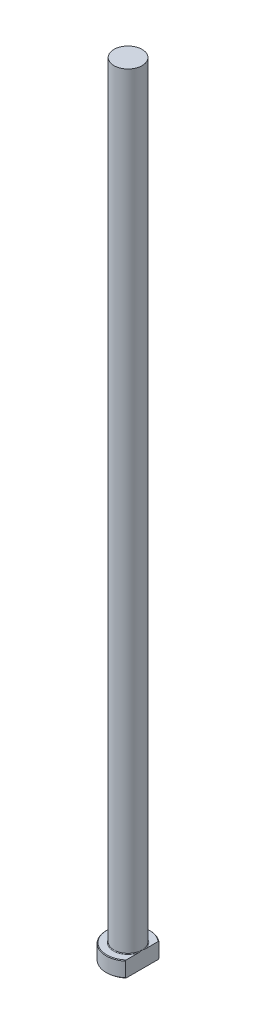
ISO-10303-21;
HEADER;
FILE_DESCRIPTION(('STEP AP214'),'2;1');
FILE_NAME('part.step','',(''),(''),'','','');
FILE_SCHEMA(('AUTOMOTIVE_DESIGN { 1 0 10303 214 1 1 1 1 }'));
ENDSEC;
DATA;
#1=APPLICATION_CONTEXT('core data for automotive mechanical design processes');
#2=APPLICATION_PROTOCOL_DEFINITION('international standard','automotive_design',2000,#1);
#3=PRODUCT_CONTEXT('',#1,'mechanical');
#4=PRODUCT('Part','Part','',(#3));
#5=PRODUCT_RELATED_PRODUCT_CATEGORY('part','',(#4));
#6=PRODUCT_DEFINITION_FORMATION('','',#4);
#7=PRODUCT_DEFINITION_CONTEXT('part definition',#1,'design');
#8=PRODUCT_DEFINITION('design','',#6,#7);
#9=PRODUCT_DEFINITION_SHAPE('','',#8);
#10=(LENGTH_UNIT() NAMED_UNIT(*) SI_UNIT(.MILLI.,.METRE.));
#11=(NAMED_UNIT(*) PLANE_ANGLE_UNIT() SI_UNIT($,.RADIAN.));
#12=(NAMED_UNIT(*) SI_UNIT($,.STERADIAN.) SOLID_ANGLE_UNIT());
#13=UNCERTAINTY_MEASURE_WITH_UNIT(LENGTH_MEASURE(1.E-05),#10,'distance_accuracy_value','');
#14=(GEOMETRIC_REPRESENTATION_CONTEXT(3) GLOBAL_UNCERTAINTY_ASSIGNED_CONTEXT((#13)) GLOBAL_UNIT_ASSIGNED_CONTEXT((#10,
#11,#12)) REPRESENTATION_CONTEXT('',''));
#15=CARTESIAN_POINT('',(0.,0.,0.));
#16=DIRECTION('',(0.,0.,1.));
#17=DIRECTION('',(1.,0.,0.));
#18=AXIS2_PLACEMENT_3D('',#15,#16,#17);
#19=CARTESIAN_POINT('',(0.,0.,0.));
#20=DIRECTION('',(0.,-1.,0.));
#21=DIRECTION('',(0.,0.,-1.));
#22=AXIS2_PLACEMENT_3D('',#19,#20,#21);
#23=PLANE('',#22);
#24=CARTESIAN_POINT('',(0.,0.,0.));
#25=DIRECTION('',(0.,-1.,0.));
#26=DIRECTION('',(0.,0.,-1.));
#27=AXIS2_PLACEMENT_3D('',#24,#25,#26);
#28=CIRCLE('',#27,6.79999999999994);
#29=CARTESIAN_POINT('',(4.49999999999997,0.,5.09803883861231));
#30=VERTEX_POINT('',#29);
#31=CARTESIAN_POINT('',(4.49999999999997,0.,-5.09803883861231));
#32=VERTEX_POINT('',#31);
#33=EDGE_CURVE('E98',#30,#32,#28,.T.);
#34=ORIENTED_EDGE('',*,*,#33,.T.);
#35=DIRECTION('',(0.,0.,1.));
#36=VECTOR('',#35,1.);
#37=CARTESIAN_POINT('',(4.49999999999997,0.,-5.36190264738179));
#38=LINE('',#37,#36);
#39=EDGE_CURVE('E83',#32,#30,#38,.T.);
#40=ORIENTED_EDGE('',*,*,#39,.T.);
#41=EDGE_LOOP('',(#34,#40));
#42=FACE_BOUND('',#41,.T.);
#43=ADVANCED_FACE('F32',(#42),#23,.T.);
#44=CARTESIAN_POINT('',(0.,259.958771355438,0.));
#45=DIRECTION('',(0.,1.,0.));
#46=DIRECTION('',(0.,0.,1.));
#47=AXIS2_PLACEMENT_3D('',#44,#45,#46);
#48=CYLINDRICAL_SURFACE('',#47,6.99999999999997);
#49=CARTESIAN_POINT('',(0.,4.80000000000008,0.));
#50=DIRECTION('',(0.,1.,0.));
#51=DIRECTION('',(0.,0.,1.));
#52=AXIS2_PLACEMENT_3D('',#49,#50,#51);
#53=CIRCLE('',#52,6.99999999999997);
#54=CARTESIAN_POINT('',(4.49999999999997,4.80000000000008,5.36190264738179));
#55=VERTEX_POINT('',#54);
#56=CARTESIAN_POINT('',(4.49999999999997,4.80000000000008,-5.36190264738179));
#57=VERTEX_POINT('',#56);
#58=EDGE_CURVE('E104',#55,#57,#53,.F.);
#59=ORIENTED_EDGE('',*,*,#58,.T.);
#60=DIRECTION('',(0.,-1.,0.));
#61=VECTOR('',#60,1.);
#62=CARTESIAN_POINT('',(4.49999999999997,250.,-5.36190264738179));
#63=LINE('',#62,#61);
#64=CARTESIAN_POINT('',(4.49999999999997,0.200000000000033,-5.36190264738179));
#65=VERTEX_POINT('',#64);
#66=EDGE_CURVE('E183',#57,#65,#63,.T.);
#67=ORIENTED_EDGE('',*,*,#66,.T.);
#68=CARTESIAN_POINT('',(0.,0.200000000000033,0.));
#69=DIRECTION('',(0.,-1.,0.));
#70=DIRECTION('',(0.,0.,-1.));
#71=AXIS2_PLACEMENT_3D('',#68,#69,#70);
#72=CIRCLE('',#71,6.99999999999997);
#73=CARTESIAN_POINT('',(4.49999999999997,0.200000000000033,5.36190264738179));
#74=VERTEX_POINT('',#73);
#75=EDGE_CURVE('E100',#65,#74,#72,.F.);
#76=ORIENTED_EDGE('',*,*,#75,.T.);
#77=DIRECTION('',(0.,-1.,0.));
#78=VECTOR('',#77,1.);
#79=CARTESIAN_POINT('',(4.49999999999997,250.,5.36190264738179));
#80=LINE('',#79,#78);
#81=EDGE_CURVE('E93',#55,#74,#80,.T.);
#82=ORIENTED_EDGE('',*,*,#81,.F.);
#83=EDGE_LOOP('',(#59,#67,#76,#82));
#84=FACE_BOUND('',#83,.T.);
#85=ADVANCED_FACE('F158',(#84),#48,.T.);
#86=CARTESIAN_POINT('',(-6.99999999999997,5.,0.));
#87=DIRECTION('',(0.,1.,0.));
#88=DIRECTION('',(0.,0.,1.));
#89=AXIS2_PLACEMENT_3D('',#86,#87,#88);
#90=PLANE('',#89);
#91=CARTESIAN_POINT('',(0.,5.,0.));
#92=DIRECTION('',(0.,1.,0.));
#93=DIRECTION('',(0.,0.,1.));
#94=AXIS2_PLACEMENT_3D('',#91,#92,#93);
#95=CIRCLE('',#94,6.80000000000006);
#96=CARTESIAN_POINT('',(4.49999999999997,5.,-5.09803883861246));
#97=VERTEX_POINT('',#96);
#98=CARTESIAN_POINT('',(4.49999999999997,5.,5.09803883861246));
#99=VERTEX_POINT('',#98);
#100=EDGE_CURVE('E178',#97,#99,#95,.T.);
#101=ORIENTED_EDGE('',*,*,#100,.T.);
#102=DIRECTION('',(0.,0.,-1.));
#103=VECTOR('',#102,1.);
#104=CARTESIAN_POINT('',(4.49999999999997,5.,0.));
#105=LINE('',#104,#103);
#106=CARTESIAN_POINT('',(4.49999999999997,4.99999999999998,1.35646599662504));
#107=VERTEX_POINT('',#106);
#108=EDGE_CURVE('E57',#99,#107,#105,.T.);
#109=ORIENTED_EDGE('',*,*,#108,.T.);
#110=CARTESIAN_POINT('',(0.,5.,0.));
#111=DIRECTION('',(0.,1.,0.));
#112=DIRECTION('',(0.,0.,1.));
#113=AXIS2_PLACEMENT_3D('',#110,#111,#112);
#114=CIRCLE('',#113,4.69999999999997);
#115=CARTESIAN_POINT('',(4.49999999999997,4.99999999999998,-1.35646599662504));
#116=VERTEX_POINT('',#115);
#117=EDGE_CURVE('E107',#107,#116,#114,.F.);
#118=ORIENTED_EDGE('',*,*,#117,.T.);
#119=EDGE_CURVE('E136',#116,#97,#105,.T.);
#120=ORIENTED_EDGE('',*,*,#119,.T.);
#121=EDGE_LOOP('',(#101,#109,#118,#120));
#122=FACE_BOUND('',#121,.T.);
#123=ADVANCED_FACE('F147',(#122),#90,.T.);
#124=CARTESIAN_POINT('',(0.,5.,0.));
#125=DIRECTION('',(0.,-1.,0.));
#126=DIRECTION('',(0.,0.,-1.));
#127=AXIS2_PLACEMENT_3D('',#124,#125,#126);
#128=CONICAL_SURFACE('',#127,6.80000000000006,0.785398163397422);
#129=ORIENTED_EDGE('',*,*,#58,.F.);
#130=CARTESIAN_POINT('',(4.49999999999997,-0.826603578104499,11.7975047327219));
#131=CARTESIAN_POINT('',(4.49999999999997,-0.656533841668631,11.6154797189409));
#132=CARTESIAN_POINT('',(4.49999999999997,-0.48672751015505,11.4332086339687));
#133=CARTESIAN_POINT('',(4.49999999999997,-0.147726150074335,11.0680967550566));
#134=CARTESIAN_POINT('',(4.49999999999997,0.0214688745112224,10.8852559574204));
#135=CARTESIAN_POINT('',(4.49999999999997,0.528086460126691,10.3356799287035));
#136=CARTESIAN_POINT('',(4.49999999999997,0.864461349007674,9.96797672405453));
#137=CARTESIAN_POINT('',(4.49999999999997,1.5359242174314,9.22638843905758));
#138=CARTESIAN_POINT('',(4.49999999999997,1.87098392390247,8.85247771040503));
#139=CARTESIAN_POINT('',(4.49999999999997,2.53567264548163,8.09993899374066));
#140=CARTESIAN_POINT('',(4.49999999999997,2.86530243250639,7.72131168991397));
#141=CARTESIAN_POINT('',(4.49999999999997,3.45461987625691,7.03004475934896));
#142=CARTESIAN_POINT('',(4.49999999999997,3.71567058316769,6.71857295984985));
#143=CARTESIAN_POINT('',(4.49999999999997,4.10171222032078,6.24673895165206));
#144=CARTESIAN_POINT('',(4.49999999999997,4.22949330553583,6.08866046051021));
#145=CARTESIAN_POINT('',(4.49999999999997,4.48278285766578,5.77069538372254));
#146=CARTESIAN_POINT('',(4.49999999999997,4.60829137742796,5.61080884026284));
#147=CARTESIAN_POINT('',(4.49999999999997,4.85630566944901,5.28917357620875));
#148=CARTESIAN_POINT('',(4.49999999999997,4.97881640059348,5.12742868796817));
#149=CARTESIAN_POINT('',(4.49999999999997,5.22038566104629,4.80138722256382));
#150=CARTESIAN_POINT('',(4.49999999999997,5.33944438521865,4.63709079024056));
#151=CARTESIAN_POINT('',(4.49999999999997,5.57315514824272,4.30551121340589));
#152=CARTESIAN_POINT('',(4.49999999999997,5.68780947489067,4.13822968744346));
#153=CARTESIAN_POINT('',(4.49999999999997,5.9115477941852,3.79999593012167));
#154=CARTESIAN_POINT('',(4.49999999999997,6.0206326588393,3.62904427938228));
#155=CARTESIAN_POINT('',(4.49999999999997,6.21658595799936,3.30732260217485));
#156=CARTESIAN_POINT('',(4.49999999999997,6.30440873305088,3.15713645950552));
#157=CARTESIAN_POINT('',(4.49999999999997,6.47332532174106,2.85297503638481));
#158=CARTESIAN_POINT('',(4.49999999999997,6.55441838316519,2.69899933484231));
#159=CARTESIAN_POINT('',(4.49999999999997,6.70797622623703,2.38687180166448));
#160=CARTESIAN_POINT('',(4.49999999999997,6.78044573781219,2.22872231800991));
#161=CARTESIAN_POINT('',(4.49999999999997,6.914451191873,1.90783021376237));
#162=CARTESIAN_POINT('',(4.49999999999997,6.97598991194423,1.74508877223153));
#163=CARTESIAN_POINT('',(4.49999999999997,7.07411688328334,1.44888794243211));
#164=CARTESIAN_POINT('',(4.49999999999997,7.11323376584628,1.31627139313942));
#165=CARTESIAN_POINT('',(4.49999999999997,7.18128524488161,1.04846462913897));
#166=CARTESIAN_POINT('',(4.49999999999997,7.21022354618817,0.913275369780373));
#167=CARTESIAN_POINT('',(4.49999999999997,7.25649613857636,0.641333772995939));
#168=CARTESIAN_POINT('',(4.49999999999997,7.27386660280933,0.504587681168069));
#169=CARTESIAN_POINT('',(4.49999999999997,7.29619809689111,0.230076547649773));
#170=CARTESIAN_POINT('',(4.49999999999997,7.30115982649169,0.0923115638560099));
#171=CARTESIAN_POINT('',(4.49999999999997,7.2983786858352,-0.18345502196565));
#172=CARTESIAN_POINT('',(4.49999999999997,7.29060196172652,-0.321456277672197));
#173=CARTESIAN_POINT('',(4.49999999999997,7.26273607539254,-0.596199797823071));
#174=CARTESIAN_POINT('',(4.49999999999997,7.24264594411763,-0.732941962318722));
#175=CARTESIAN_POINT('',(4.49999999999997,7.1911463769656,-1.00468961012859));
#176=CARTESIAN_POINT('',(4.49999999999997,7.15970172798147,-1.13968832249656));
#177=CARTESIAN_POINT('',(4.49999999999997,7.08693261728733,-1.40696616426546));
#178=CARTESIAN_POINT('',(4.49999999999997,7.04560769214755,-1.53924516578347));
#179=CARTESIAN_POINT('',(4.49999999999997,6.94926301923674,-1.81615594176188));
#180=CARTESIAN_POINT('',(4.49999999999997,6.89320710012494,-1.96042418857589));
#181=CARTESIAN_POINT('',(4.49999999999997,6.77257673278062,-2.24536359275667));
#182=CARTESIAN_POINT('',(4.49999999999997,6.70799968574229,-2.38603363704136));
#183=CARTESIAN_POINT('',(4.49999999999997,6.57186656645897,-2.66422978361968));
#184=CARTESIAN_POINT('',(4.49999999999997,6.50029866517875,-2.80175005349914));
#185=CARTESIAN_POINT('',(4.49999999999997,6.35162424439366,-3.07372108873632));
#186=CARTESIAN_POINT('',(4.49999999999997,6.27451843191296,-3.20817224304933));
#187=CARTESIAN_POINT('',(4.49999999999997,6.11478562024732,-3.47611571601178));
#188=CARTESIAN_POINT('',(4.49999999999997,6.03209988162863,-3.6095728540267));
#189=CARTESIAN_POINT('',(4.49999999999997,5.8629804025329,-3.87408571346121));
#190=CARTESIAN_POINT('',(4.49999999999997,5.77654657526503,-4.00514137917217));
#191=CARTESIAN_POINT('',(4.49999999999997,5.6006924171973,-4.26503919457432));
#192=CARTESIAN_POINT('',(4.49999999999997,5.51127511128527,-4.39388339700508));
#193=CARTESIAN_POINT('',(4.49999999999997,5.32990145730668,-4.64976494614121));
#194=CARTESIAN_POINT('',(4.49999999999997,5.2379451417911,-4.77680231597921));
#195=CARTESIAN_POINT('',(4.49999999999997,5.02845923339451,-5.06114674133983));
#196=CARTESIAN_POINT('',(4.49999999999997,4.91032759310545,-5.21800978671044));
#197=CARTESIAN_POINT('',(4.49999999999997,4.67137262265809,-5.52967502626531));
#198=CARTESIAN_POINT('',(4.49999999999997,4.55054918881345,-5.6844771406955));
#199=CARTESIAN_POINT('',(4.49999999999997,4.18476750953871,-6.14632269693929));
#200=CARTESIAN_POINT('',(4.49999999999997,3.93652718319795,-6.45076612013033));
#201=CARTESIAN_POINT('',(4.49999999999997,3.433758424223,-7.05492264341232));
#202=CARTESIAN_POINT('',(4.49999999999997,3.17922364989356,-7.35463042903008));
#203=CARTESIAN_POINT('',(4.49999999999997,2.66577175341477,-7.95027689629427));
#204=CARTESIAN_POINT('',(4.49999999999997,2.40685449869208,-8.24621546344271));
#205=CARTESIAN_POINT('',(4.49999999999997,1.90253774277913,-8.81624717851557));
#206=CARTESIAN_POINT('',(4.49999999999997,1.6573410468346,-9.0905201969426));
#207=CARTESIAN_POINT('',(4.49999999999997,1.16472214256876,-9.63707062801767));
#208=CARTESIAN_POINT('',(4.49999999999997,0.91729987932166,-9.90934799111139));
#209=CARTESIAN_POINT('',(4.49999999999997,0.421259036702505,-10.4516873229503));
#210=CARTESIAN_POINT('',(4.49999999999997,0.172644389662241,-10.7217528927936));
#211=CARTESIAN_POINT('',(4.49999999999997,-0.325997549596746,-11.2605533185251));
#212=CARTESIAN_POINT('',(4.49999999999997,-0.576024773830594,-11.5292882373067));
#213=CARTESIAN_POINT('',(4.49999999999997,-0.826603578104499,-11.7975047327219));
#214=B_SPLINE_CURVE_WITH_KNOTS('',3,(#130,#131,#132,#133,#134,#135,#136,#137,#138,#139,#140,
#141,#142,#143,#144,#145,#146,#147,#148,#149,#150,#151,#152,#153,#154,#155,#156,#157,#158,#159,
#160,#161,#162,#163,#164,#165,#166,#167,#168,#169,#170,#171,#172,#173,#174,#175,#176,#177,#178,
#179,#180,#181,#182,#183,#184,#185,#186,#187,#188,#189,#190,#191,#192,#193,#194,#195,#196,#197,
#198,#199,#200,#201,#202,#203,#204,#205,#206,#207,#208,#209,#210,#211,#212,#213),.UNSPECIFIED.,
.F.,.F.,(4,2,2,2,2,2,2,2,2,2,2,2,2,2,2,2,2,2,2,2,2,2,2,2,2,2,2,2,2,2,2,2,2,2,2,2,2,2,2,2,2,4),
(0.,0.747335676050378,1.49467621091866,2.98970927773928,4.49588412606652,6.00184297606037,
7.22095514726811,7.83073509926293,8.44050085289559,9.04917844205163,9.65782160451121,
10.2661442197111,10.8743712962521,11.396174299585,11.9180355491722,12.4396092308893,
12.9610501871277,13.3755059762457,13.789810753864,14.2028138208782,14.6157935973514,
15.0298726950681,15.4439843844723,15.8593915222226,16.2748181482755,16.7388057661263,
17.2029352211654,17.6678640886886,18.1327337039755,18.6036459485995,19.0745691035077,
19.5450285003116,20.0154818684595,20.6045534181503,21.1936476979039,22.3719830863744,
23.5515583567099,24.7311693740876,25.8348416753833,26.9385412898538,28.0397632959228,
29.1409327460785),.UNSPECIFIED.);
#215=EDGE_CURVE('E135',#55,#99,#214,.T.);
#216=ORIENTED_EDGE('',*,*,#215,.T.);
#217=ORIENTED_EDGE('',*,*,#100,.F.);
#218=EDGE_CURVE('E127',#97,#57,#214,.T.);
#219=ORIENTED_EDGE('',*,*,#218,.T.);
#220=EDGE_LOOP('',(#129,#216,#217,#219));
#221=FACE_BOUND('',#220,.T.);
#222=ADVANCED_FACE('F143',(#221),#128,.T.);
#223=CARTESIAN_POINT('',(0.,0.200000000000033,0.));
#224=DIRECTION('',(0.,1.,0.));
#225=DIRECTION('',(0.,0.,1.));
#226=AXIS2_PLACEMENT_3D('',#223,#224,#225);
#227=CONICAL_SURFACE('',#226,6.99999999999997,0.785398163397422);
#228=ORIENTED_EDGE('',*,*,#75,.F.);
#229=CARTESIAN_POINT('',(4.49999999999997,5.82660357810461,-11.7975047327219));
#230=CARTESIAN_POINT('',(4.49999999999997,5.65653384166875,-11.6154797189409));
#231=CARTESIAN_POINT('',(4.49999999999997,5.48672751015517,-11.4332086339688));
#232=CARTESIAN_POINT('',(4.49999999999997,5.14772615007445,-11.0680967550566));
#233=CARTESIAN_POINT('',(4.49999999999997,4.97853112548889,-10.8852559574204));
#234=CARTESIAN_POINT('',(4.49999999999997,4.47191353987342,-10.3356799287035));
#235=CARTESIAN_POINT('',(4.49999999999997,4.13553865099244,-9.96797672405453));
#236=CARTESIAN_POINT('',(4.49999999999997,3.46407578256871,-9.22638843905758));
#237=CARTESIAN_POINT('',(4.49999999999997,3.12901607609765,-8.85247771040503));
#238=CARTESIAN_POINT('',(4.49999999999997,2.46432735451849,-8.09993899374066));
#239=CARTESIAN_POINT('',(4.49999999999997,2.13469756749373,-7.72131168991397));
#240=CARTESIAN_POINT('',(4.49999999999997,1.54538012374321,-7.03004475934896));
#241=CARTESIAN_POINT('',(4.49999999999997,1.28432941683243,-6.71857295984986));
#242=CARTESIAN_POINT('',(4.49999999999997,0.898287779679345,-6.24673895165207));
#243=CARTESIAN_POINT('',(4.49999999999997,0.770506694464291,-6.08866046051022));
#244=CARTESIAN_POINT('',(4.49999999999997,0.517217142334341,-5.77069538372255));
#245=CARTESIAN_POINT('',(4.49999999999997,0.391708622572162,-5.61080884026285));
#246=CARTESIAN_POINT('',(4.49999999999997,0.14369433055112,-5.28917357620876));
#247=CARTESIAN_POINT('',(4.49999999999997,0.021183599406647,-5.12742868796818));
#248=CARTESIAN_POINT('',(4.49999999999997,-0.220385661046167,-4.80138722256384));
#249=CARTESIAN_POINT('',(4.49999999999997,-0.339444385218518,-4.63709079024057));
#250=CARTESIAN_POINT('',(4.49999999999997,-0.573155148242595,-4.3055112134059));
#251=CARTESIAN_POINT('',(4.49999999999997,-0.68780947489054,-4.13822968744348));
#252=CARTESIAN_POINT('',(4.49999999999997,-0.911547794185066,-3.79999593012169));
#253=CARTESIAN_POINT('',(4.49999999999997,-1.02063265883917,-3.62904427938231));
#254=CARTESIAN_POINT('',(4.49999999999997,-1.21658595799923,-3.30732260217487));
#255=CARTESIAN_POINT('',(4.49999999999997,-1.30440873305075,-3.15713645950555));
#256=CARTESIAN_POINT('',(4.49999999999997,-1.47332532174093,-2.85297503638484));
#257=CARTESIAN_POINT('',(4.49999999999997,-1.55441838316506,-2.69899933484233));
#258=CARTESIAN_POINT('',(4.49999999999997,-1.7079762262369,-2.38687180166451));
#259=CARTESIAN_POINT('',(4.49999999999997,-1.78044573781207,-2.22872231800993));
#260=CARTESIAN_POINT('',(4.49999999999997,-1.91445119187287,-1.9078302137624));
#261=CARTESIAN_POINT('',(4.49999999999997,-1.97598991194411,-1.74508877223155));
#262=CARTESIAN_POINT('',(4.49999999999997,-2.07411688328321,-1.44888794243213));
#263=CARTESIAN_POINT('',(4.49999999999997,-2.11323376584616,-1.31627139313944));
#264=CARTESIAN_POINT('',(4.49999999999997,-2.18128524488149,-1.04846462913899));
#265=CARTESIAN_POINT('',(4.49999999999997,-2.21022354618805,-0.913275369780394));
#266=CARTESIAN_POINT('',(4.49999999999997,-2.25649613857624,-0.641333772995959));
#267=CARTESIAN_POINT('',(4.49999999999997,-2.27386660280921,-0.504587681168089));
#268=CARTESIAN_POINT('',(4.49999999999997,-2.29619809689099,-0.230076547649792));
#269=CARTESIAN_POINT('',(4.49999999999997,-2.30115982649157,-0.0923115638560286));
#270=CARTESIAN_POINT('',(4.49999999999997,-2.29837868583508,0.183455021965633));
#271=CARTESIAN_POINT('',(4.49999999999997,-2.2906019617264,0.32145627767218));
#272=CARTESIAN_POINT('',(4.49999999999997,-2.26273607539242,0.596199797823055));
#273=CARTESIAN_POINT('',(4.49999999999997,-2.24264594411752,0.732941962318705));
#274=CARTESIAN_POINT('',(4.49999999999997,-2.19114637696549,1.00468961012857));
#275=CARTESIAN_POINT('',(4.49999999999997,-2.15970172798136,1.13968832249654));
#276=CARTESIAN_POINT('',(4.49999999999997,-2.08693261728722,1.40696616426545));
#277=CARTESIAN_POINT('',(4.49999999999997,-2.04560769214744,1.53924516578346));
#278=CARTESIAN_POINT('',(4.49999999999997,-1.94926301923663,1.81615594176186));
#279=CARTESIAN_POINT('',(4.49999999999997,-1.89320710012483,1.96042418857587));
#280=CARTESIAN_POINT('',(4.49999999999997,-1.77257673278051,2.24536359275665));
#281=CARTESIAN_POINT('',(4.49999999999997,-1.70799968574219,2.38603363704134));
#282=CARTESIAN_POINT('',(4.49999999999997,-1.57186656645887,2.66422978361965));
#283=CARTESIAN_POINT('',(4.49999999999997,-1.50029866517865,2.80175005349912));
#284=CARTESIAN_POINT('',(4.49999999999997,-1.35162424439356,3.07372108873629));
#285=CARTESIAN_POINT('',(4.49999999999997,-1.27451843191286,3.2081722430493));
#286=CARTESIAN_POINT('',(4.49999999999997,-1.11478562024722,3.47611571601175));
#287=CARTESIAN_POINT('',(4.49999999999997,-1.03209988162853,3.60957285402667));
#288=CARTESIAN_POINT('',(4.49999999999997,-0.862980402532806,3.87408571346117));
#289=CARTESIAN_POINT('',(4.49999999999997,-0.776546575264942,4.00514137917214));
#290=CARTESIAN_POINT('',(4.49999999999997,-0.600692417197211,4.26503919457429));
#291=CARTESIAN_POINT('',(4.49999999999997,-0.511275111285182,4.39388339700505));
#292=CARTESIAN_POINT('',(4.49999999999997,-0.329901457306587,4.64976494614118));
#293=CARTESIAN_POINT('',(4.49999999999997,-0.237945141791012,4.77680231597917));
#294=CARTESIAN_POINT('',(4.49999999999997,-0.0284592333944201,5.06114674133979));
#295=CARTESIAN_POINT('',(4.49999999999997,0.0896724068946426,5.21800978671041));
#296=CARTESIAN_POINT('',(4.49999999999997,0.328627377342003,5.52967502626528));
#297=CARTESIAN_POINT('',(4.49999999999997,0.449450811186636,5.68447714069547));
#298=CARTESIAN_POINT('',(4.49999999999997,0.81523249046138,6.14632269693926));
#299=CARTESIAN_POINT('',(4.49999999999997,1.06347281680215,6.45076612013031));
#300=CARTESIAN_POINT('',(4.49999999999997,1.5662415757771,7.05492264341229));
#301=CARTESIAN_POINT('',(4.49999999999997,1.82077635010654,7.35463042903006));
#302=CARTESIAN_POINT('',(4.49999999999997,2.33422824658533,7.95027689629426));
#303=CARTESIAN_POINT('',(4.49999999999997,2.59314550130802,8.24621546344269));
#304=CARTESIAN_POINT('',(4.49999999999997,3.09746225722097,8.81624717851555));
#305=CARTESIAN_POINT('',(4.49999999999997,3.3426589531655,9.09052019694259));
#306=CARTESIAN_POINT('',(4.49999999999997,3.83527785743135,9.63707062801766));
#307=CARTESIAN_POINT('',(4.49999999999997,4.08270012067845,9.90934799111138));
#308=CARTESIAN_POINT('',(4.49999999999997,4.5787409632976,10.4516873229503));
#309=CARTESIAN_POINT('',(4.49999999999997,4.82735561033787,10.7217528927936));
#310=CARTESIAN_POINT('',(4.49999999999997,5.32599754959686,11.2605533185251));
#311=CARTESIAN_POINT('',(4.49999999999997,5.57602477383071,11.5292882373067));
#312=CARTESIAN_POINT('',(4.49999999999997,5.82660357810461,11.7975047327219));
#313=B_SPLINE_CURVE_WITH_KNOTS('',3,(#229,#230,#231,#232,#233,#234,#235,#236,#237,#238,#239,
#240,#241,#242,#243,#244,#245,#246,#247,#248,#249,#250,#251,#252,#253,#254,#255,#256,#257,#258,
#259,#260,#261,#262,#263,#264,#265,#266,#267,#268,#269,#270,#271,#272,#273,#274,#275,#276,#277,
#278,#279,#280,#281,#282,#283,#284,#285,#286,#287,#288,#289,#290,#291,#292,#293,#294,#295,#296,
#297,#298,#299,#300,#301,#302,#303,#304,#305,#306,#307,#308,#309,#310,#311,#312),.UNSPECIFIED.,
.F.,.F.,(4,2,2,2,2,2,2,2,2,2,2,2,2,2,2,2,2,2,2,2,2,2,2,2,2,2,2,2,2,2,2,2,2,2,2,2,2,2,2,2,2,4),
(0.,0.747335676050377,1.49467621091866,2.98970927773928,4.49588412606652,6.00184297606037,
7.2209551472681,7.83073509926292,8.44050085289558,9.04917844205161,9.65782160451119,
10.266144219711,10.874371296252,11.3961742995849,11.9180355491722,12.4396092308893,
12.9610501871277,13.3755059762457,13.789810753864,14.2028138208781,14.6157935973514,
15.029872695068,15.4439843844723,15.8593915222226,16.2748181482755,16.7388057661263,
17.2029352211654,17.6678640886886,18.1327337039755,18.6036459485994,19.0745691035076,
19.5450285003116,20.0154818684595,20.6045534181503,21.1936476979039,22.3719830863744,
23.5515583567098,24.7311693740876,25.8348416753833,26.9385412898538,28.0397632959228,
29.1409327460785),.UNSPECIFIED.);
#314=EDGE_CURVE('E86',#65,#32,#313,.T.);
#315=ORIENTED_EDGE('',*,*,#314,.T.);
#316=ORIENTED_EDGE('',*,*,#33,.F.);
#317=EDGE_CURVE('E89',#30,#74,#313,.T.);
#318=ORIENTED_EDGE('',*,*,#317,.T.);
#319=EDGE_LOOP('',(#228,#315,#316,#318));
#320=FACE_BOUND('',#319,.T.);
#321=ADVANCED_FACE('F97',(#320),#227,.T.);
#322=CARTESIAN_POINT('',(0.,5.19999999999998,0.));
#323=DIRECTION('',(0.,1.,0.));
#324=DIRECTION('',(0.,0.,1.));
#325=AXIS2_PLACEMENT_3D('',#322,#323,#324);
#326=TOROIDAL_SURFACE('',#325,4.69999999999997,0.2);
#327=CARTESIAN_POINT('',(4.49999999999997,5.19999999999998,0.));
#328=CARTESIAN_POINT('',(4.49999999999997,5.20000055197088,-6.82190207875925E-09));
#329=CARTESIAN_POINT('',(4.49999999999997,5.20000110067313,-2.8507749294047E-07));
#330=CARTESIAN_POINT('',(4.49999999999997,5.20000211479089,-1.011869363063E-06));
#331=CARTESIAN_POINT('',(4.49999999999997,5.20000255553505,-1.47962814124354E-06));
#332=CARTESIAN_POINT('',(4.49999999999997,5.20000349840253,-2.60944744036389E-06));
#333=CARTESIAN_POINT('',(4.49999999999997,5.2000039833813,-3.28932128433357E-06));
#334=CARTESIAN_POINT('',(4.49999999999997,5.20000482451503,-4.67191774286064E-06));
#335=CARTESIAN_POINT('',(4.49999999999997,5.20000518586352,-5.37183781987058E-06));
#336=CARTESIAN_POINT('',(4.49999999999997,5.2000065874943,-8.170073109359E-06));
#337=CARTESIAN_POINT('',(4.49999999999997,5.2000075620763,-1.03053692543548E-05));
#338=CARTESIAN_POINT('',(4.49999999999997,5.20000909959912,-1.44577153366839E-05));
#339=CARTESIAN_POINT('',(4.49999999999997,5.20000969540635,-1.64630059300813E-05));
#340=CARTESIAN_POINT('',(4.49999999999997,5.20001228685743,-2.51554967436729E-05));
#341=CARTESIAN_POINT('',(4.49999999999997,5.20001430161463,-3.18381715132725E-05));
#342=CARTESIAN_POINT('',(4.49999999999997,5.20001716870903,-4.42838289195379E-05));
#343=CARTESIAN_POINT('',(4.49999999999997,5.20001815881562,-5.00144685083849E-05));
#344=CARTESIAN_POINT('',(4.49999999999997,5.20002543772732,-9.26835273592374E-05));
#345=CARTESIAN_POINT('',(4.49999999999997,5.20003122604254,-0.000129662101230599));
#346=CARTESIAN_POINT('',(4.49999999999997,5.20005596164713,-0.000272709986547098));
#347=CARTESIAN_POINT('',(4.49999999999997,5.20007919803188,-0.00037804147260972));
#348=CARTESIAN_POINT('',(4.49999999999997,5.20016600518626,-0.000777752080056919));
#349=CARTESIAN_POINT('',(4.49999999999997,5.2002271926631,-0.00107246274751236));
#350=CARTESIAN_POINT('',(4.49999999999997,5.20046266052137,-0.00220073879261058));
#351=CARTESIAN_POINT('',(4.49999999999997,5.20063910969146,-0.00303403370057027));
#352=CARTESIAN_POINT('',(4.49999999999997,5.20146807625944,-0.00695397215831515));
#353=CARTESIAN_POINT('',(4.49999999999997,5.20211775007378,-0.0100409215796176));
#354=CARTESIAN_POINT('',(4.49999999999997,5.2104625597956,-0.0496851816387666));
#355=CARTESIAN_POINT('',(4.49999999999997,5.2181721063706,-0.0862414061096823));
#356=CARTESIAN_POINT('',(4.49999999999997,5.23425793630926,-0.163016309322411));
#357=CARTESIAN_POINT('',(4.49999999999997,5.24262411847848,-0.203237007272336));
#358=CARTESIAN_POINT('',(4.49999999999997,5.25647489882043,-0.270691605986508));
#359=CARTESIAN_POINT('',(4.49999999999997,5.26201543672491,-0.297913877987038));
#360=CARTESIAN_POINT('',(4.49999999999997,5.27283497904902,-0.351731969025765));
#361=CARTESIAN_POINT('',(4.49999999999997,5.27811706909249,-0.378327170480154));
#362=CARTESIAN_POINT('',(4.49999999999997,5.29540054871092,-0.466700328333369));
#363=CARTESIAN_POINT('',(4.49999999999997,5.30706090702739,-0.528546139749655));
#364=CARTESIAN_POINT('',(4.49999999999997,5.32919553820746,-0.652993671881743));
#365=CARTESIAN_POINT('',(4.49999999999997,5.33965890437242,-0.715597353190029));
#366=CARTESIAN_POINT('',(4.49999999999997,5.35981150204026,-0.848050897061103));
#367=CARTESIAN_POINT('',(4.49999999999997,5.36928619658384,-0.917934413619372));
#368=CARTESIAN_POINT('',(4.49999999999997,5.38501179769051,-1.05789403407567));
#369=CARTESIAN_POINT('',(4.49999999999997,5.39127087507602,-1.12796919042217));
#370=CARTESIAN_POINT('',(4.49999999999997,5.39912931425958,-1.26576099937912));
#371=CARTESIAN_POINT('',(4.49999999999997,5.40089657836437,-1.33346617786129));
#372=CARTESIAN_POINT('',(4.49999999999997,5.39892238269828,-1.43427893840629));
#373=CARTESIAN_POINT('',(4.49999999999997,5.39752994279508,-1.46742827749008));
#374=CARTESIAN_POINT('',(4.49999999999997,5.39286046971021,-1.53357775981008));
#375=CARTESIAN_POINT('',(4.49999999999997,5.38958468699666,-1.56657798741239));
#376=CARTESIAN_POINT('',(4.49999999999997,5.38053340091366,-1.63263406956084));
#377=CARTESIAN_POINT('',(4.49999999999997,5.37473096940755,-1.66568659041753));
#378=CARTESIAN_POINT('',(4.49999999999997,5.363351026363,-1.71471614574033));
#379=CARTESIAN_POINT('',(4.49999999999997,5.35910046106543,-1.73099981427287));
#380=CARTESIAN_POINT('',(4.49999999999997,5.34948134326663,-1.76322922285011));
#381=CARTESIAN_POINT('',(4.49999999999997,5.34411369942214,-1.77917522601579));
#382=CARTESIAN_POINT('',(4.49999999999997,5.33191498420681,-1.81057972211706));
#383=CARTESIAN_POINT('',(4.49999999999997,5.32507796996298,-1.82603593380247));
#384=CARTESIAN_POINT('',(4.49999999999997,5.30945990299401,-1.85590044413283));
#385=CARTESIAN_POINT('',(4.49999999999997,5.3006900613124,-1.87031417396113));
#386=CARTESIAN_POINT('',(4.49999999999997,5.28636937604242,-1.88912645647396));
#387=CARTESIAN_POINT('',(4.49999999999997,5.28198345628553,-1.89440539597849));
#388=CARTESIAN_POINT('',(4.49999999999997,5.27265048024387,-1.90446776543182));
#389=CARTESIAN_POINT('',(4.49999999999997,5.26770253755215,-1.90925038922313));
#390=CARTESIAN_POINT('',(4.49999999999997,5.25711045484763,-1.91814546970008));
#391=CARTESIAN_POINT('',(4.49999999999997,5.25145790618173,-1.92224813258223));
#392=CARTESIAN_POINT('',(4.49999999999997,5.23949451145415,-1.92934216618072));
#393=CARTESIAN_POINT('',(4.49999999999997,5.23318629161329,-1.93233776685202));
#394=CARTESIAN_POINT('',(4.49999999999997,5.22225980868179,-1.93605363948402));
#395=CARTESIAN_POINT('',(4.49999999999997,5.21778688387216,-1.93720033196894));
#396=CARTESIAN_POINT('',(4.49999999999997,5.20871133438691,-1.93872266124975));
#397=CARTESIAN_POINT('',(4.49999999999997,5.20410881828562,-1.9390989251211));
#398=CARTESIAN_POINT('',(4.49999999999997,5.19490368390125,-1.939041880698));
#399=CARTESIAN_POINT('',(4.49999999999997,5.19030107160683,-1.93860763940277));
#400=CARTESIAN_POINT('',(4.49999999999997,5.18123418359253,-1.93697295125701));
#401=CARTESIAN_POINT('',(4.49999999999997,5.17677002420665,-1.93577187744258));
#402=CARTESIAN_POINT('',(4.49999999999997,5.1668471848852,-1.93227382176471));
#403=CARTESIAN_POINT('',(4.49999999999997,5.16146458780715,-1.92976289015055));
#404=CARTESIAN_POINT('',(4.49999999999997,5.15117210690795,-1.92391275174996));
#405=CARTESIAN_POINT('',(4.49999999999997,5.1462632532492,-1.92057179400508));
#406=CARTESIAN_POINT('',(4.49999999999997,5.13406500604,-1.91106955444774));
#407=CARTESIAN_POINT('',(4.49999999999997,5.1271509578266,-1.90443135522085));
#408=CARTESIAN_POINT('',(4.49999999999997,5.1143641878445,-1.89022781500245));
#409=CARTESIAN_POINT('',(4.49999999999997,5.10849431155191,-1.88266003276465));
#410=CARTESIAN_POINT('',(4.49999999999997,5.09196345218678,-1.85885313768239));
#411=CARTESIAN_POINT('',(4.49999999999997,5.08260528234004,-1.84172098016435));
#412=CARTESIAN_POINT('',(4.49999999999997,5.0661847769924,-1.80641645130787));
#413=CARTESIAN_POINT('',(4.49999999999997,5.05912924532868,-1.78824118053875));
#414=CARTESIAN_POINT('',(4.49999999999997,5.04323663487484,-1.74113187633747));
#415=CARTESIAN_POINT('',(4.49999999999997,5.03557186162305,-1.7118061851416));
#416=CARTESIAN_POINT('',(4.49999999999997,5.02293045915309,-1.6525641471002));
#417=CARTESIAN_POINT('',(4.49999999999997,5.01795986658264,-1.62264662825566));
#418=CARTESIAN_POINT('',(4.49999999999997,5.01001791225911,-1.56241066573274));
#419=CARTESIAN_POINT('',(4.49999999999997,5.00705603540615,-1.53209099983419));
#420=CARTESIAN_POINT('',(4.49999999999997,5.00272853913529,-1.4713805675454));
#421=CARTESIAN_POINT('',(4.49999999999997,5.00136115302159,-1.44098991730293));
#422=CARTESIAN_POINT('',(4.49999999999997,4.99922532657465,-1.3517640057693));
#423=CARTESIAN_POINT('',(4.49999999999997,5.00021079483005,-1.29288773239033));
#424=CARTESIAN_POINT('',(4.49999999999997,5.00555979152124,-1.17527759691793));
#425=CARTESIAN_POINT('',(4.49999999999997,5.0099258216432,-1.11654387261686));
#426=CARTESIAN_POINT('',(4.49999999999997,5.02118223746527,-0.999199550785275));
#427=CARTESIAN_POINT('',(4.49999999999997,5.02807797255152,-0.940589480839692));
#428=CARTESIAN_POINT('',(4.49999999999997,5.04376271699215,-0.823619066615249));
#429=CARTESIAN_POINT('',(4.49999999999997,5.05255207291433,-0.765258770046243));
#430=CARTESIAN_POINT('',(4.49999999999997,5.08097305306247,-0.59074120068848));
#431=CARTESIAN_POINT('',(4.49999999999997,5.10268261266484,-0.474928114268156));
#432=CARTESIAN_POINT('',(4.49999999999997,5.14864719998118,-0.243827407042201));
#433=CARTESIAN_POINT('',(4.49999999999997,5.1729024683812,-0.128539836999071));
#434=CARTESIAN_POINT('',(4.49999999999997,5.19721381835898,-0.013216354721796));
#435=CARTESIAN_POINT('',(4.49999999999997,5.19722314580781,-0.0131721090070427));
#436=CARTESIAN_POINT('',(4.49999999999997,5.19779043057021,-0.0104809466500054));
#437=CARTESIAN_POINT('',(4.49999999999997,5.19834611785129,-0.00783370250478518));
#438=CARTESIAN_POINT('',(4.49999999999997,5.19915446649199,-0.00401576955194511));
#439=CARTESIAN_POINT('',(4.49999999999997,5.19940338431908,-0.00284453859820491));
#440=CARTESIAN_POINT('',(4.49999999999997,5.19972657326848,-0.00129224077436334));
#441=CARTESIAN_POINT('',(4.49999999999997,5.19980524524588,-0.000911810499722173));
#442=CARTESIAN_POINT('',(4.49999999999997,5.19991316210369,-0.000412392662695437));
#443=CARTESIAN_POINT('',(4.49999999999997,5.199939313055,-0.000292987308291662));
#444=CARTESIAN_POINT('',(4.49999999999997,5.19996676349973,-0.000133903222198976));
#445=CARTESIAN_POINT('',(4.49999999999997,5.19997289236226,-9.50488513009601E-05));
#446=CARTESIAN_POINT('',(4.49999999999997,5.19998085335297,-5.04499399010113E-05));
#447=CARTESIAN_POINT('',(4.49999999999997,5.19998191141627,-4.46245658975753E-05));
#448=CARTESIAN_POINT('',(4.49999999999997,5.19998498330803,-3.19756841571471E-05));
#449=CARTESIAN_POINT('',(4.49999999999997,5.19998714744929,-2.518933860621E-05));
#450=CARTESIAN_POINT('',(4.49999999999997,5.19998992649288,-1.63868871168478E-05));
#451=CARTESIAN_POINT('',(4.49999999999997,5.19999055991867,-1.43745410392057E-05));
#452=CARTESIAN_POINT('',(4.49999999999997,5.19999218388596,-1.02133648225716E-05));
#453=CARTESIAN_POINT('',(4.49999999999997,5.19999320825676,-8.07729849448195E-06));
#454=CARTESIAN_POINT('',(4.49999999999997,5.19999467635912,-5.28414581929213E-06));
#455=CARTESIAN_POINT('',(4.49999999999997,5.19999505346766,-4.58771677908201E-06));
#456=CARTESIAN_POINT('',(4.49999999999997,5.19999592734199,-3.21494462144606E-06));
#457=CARTESIAN_POINT('',(4.49999999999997,5.19999642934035,-2.5415638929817E-06));
#458=CARTESIAN_POINT('',(4.49999999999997,5.19999740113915,-1.42657027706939E-06));
#459=CARTESIAN_POINT('',(4.49999999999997,5.19999785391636,-9.66495650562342E-07));
#460=CARTESIAN_POINT('',(4.49999999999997,5.19999888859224,-2.59794050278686E-07));
#461=CARTESIAN_POINT('',(4.49999999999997,5.19999944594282,6.84768658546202E-09));
#462=CARTESIAN_POINT('',(4.49999999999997,5.19999999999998,0.));
#463=B_SPLINE_CURVE_WITH_KNOTS('',3,(#327,#328,#329,#330,#331,#332,#333,#334,#335,#336,#337,
#338,#339,#340,#341,#342,#343,#344,#345,#346,#347,#348,#349,#350,#351,#352,#353,#354,#355,#356,
#357,#358,#359,#360,#361,#362,#363,#364,#365,#366,#367,#368,#369,#370,#371,#372,#373,#374,#375,
#376,#377,#378,#379,#380,#381,#382,#383,#384,#385,#386,#387,#388,#389,#390,#391,#392,#393,#394,
#395,#396,#397,#398,#399,#400,#401,#402,#403,#404,#405,#406,#407,#408,#409,#410,#411,#412,#413,
#414,#415,#416,#417,#418,#419,#420,#421,#422,#423,#424,#425,#426,#427,#428,#429,#430,#431,#432,
#433,#434,#435,#436,#437,#438,#439,#440,#441,#442,#443,#444,#445,#446,#447,#448,#449,#450,#451,
#452,#453,#454,#455,#456,#457,#458,#459,#460,#461,#462),.UNSPECIFIED.,.T.,.F.,(4,2,2,2,2,2,2,2,
2,2,2,2,2,2,2,2,2,2,2,2,2,2,2,2,2,2,2,2,2,2,2,2,2,2,2,2,2,2,2,2,2,2,2,2,2,2,2,2,2,2,2,2,2,2,2,2,
2,2,2,2,2,2,2,2,2,2,2,4),(0.,1.69150264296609E-06,3.63558631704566E-06,6.12166225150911E-06,
8.48452135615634E-06,1.55048842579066E-05,2.17748008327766E-05,4.26896425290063E-05,
6.01187537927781E-05,0.000172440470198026,0.000495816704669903,0.00139901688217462,
0.00395409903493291,0.0134181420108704,0.125496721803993,0.248741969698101,0.332082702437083,
0.413426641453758,0.602223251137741,0.792622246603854,1.00413639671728,1.21511040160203,
1.4180738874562,1.51756782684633,1.61699578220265,1.71751038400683,1.76796997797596,
1.81838868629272,1.86901528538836,1.9193556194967,1.9399151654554,1.96050759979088,
1.98137480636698,2.0021614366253,2.01595568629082,2.0297387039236,2.04353759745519,
2.05734778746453,2.0750662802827,2.0928224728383,2.12141432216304,2.1500829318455,
2.20832061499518,2.26672885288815,2.35743544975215,2.44834445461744,2.53967978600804,
2.63091382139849,2.80740805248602,2.98403301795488,3.1610336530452,3.33806671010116,
3.69147200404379,4.04491074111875,4.04504639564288,4.0531616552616,4.0567534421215,
4.05791916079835,4.0582856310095,4.05840367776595,4.058421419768,4.0584427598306,
4.05844908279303,4.05845616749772,4.05845854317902,4.05846104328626,4.05846299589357,
4.05846469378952),.UNSPECIFIED.);
#464=CARTESIAN_POINT('',(4.49999999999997,5.19999999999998,0.));
#465=VERTEX_POINT('',#464);
#466=EDGE_CURVE('E11',#116,#465,#463,.T.);
#467=ORIENTED_EDGE('',*,*,#466,.F.);
#468=ORIENTED_EDGE('',*,*,#117,.F.);
#469=CARTESIAN_POINT('',(4.49999999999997,5.19999999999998,0.));
#470=CARTESIAN_POINT('',(4.49999999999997,5.19999944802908,6.82190212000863E-09));
#471=CARTESIAN_POINT('',(4.49999999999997,5.19999889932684,2.85077492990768E-07));
#472=CARTESIAN_POINT('',(4.49999999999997,5.19999788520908,1.01186936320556E-06));
#473=CARTESIAN_POINT('',(4.49999999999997,5.19999744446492,1.47962814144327E-06));
#474=CARTESIAN_POINT('',(4.49999999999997,5.19999650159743,2.60944744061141E-06));
#475=CARTESIAN_POINT('',(4.49999999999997,5.19999601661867,3.28932128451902E-06));
#476=CARTESIAN_POINT('',(4.49999999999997,5.19999517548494,4.6719177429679E-06));
#477=CARTESIAN_POINT('',(4.49999999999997,5.19999481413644,5.3718378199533E-06));
#478=CARTESIAN_POINT('',(4.49999999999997,5.19999341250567,8.17007310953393E-06));
#479=CARTESIAN_POINT('',(4.49999999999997,5.19999243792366,1.03053692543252E-05));
#480=CARTESIAN_POINT('',(4.49999999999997,5.19999090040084,1.44577153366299E-05));
#481=CARTESIAN_POINT('',(4.49999999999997,5.19999030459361,1.64630059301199E-05));
#482=CARTESIAN_POINT('',(4.49999999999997,5.19998771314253,2.51554967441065E-05));
#483=CARTESIAN_POINT('',(4.49999999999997,5.19998569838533,3.18381715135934E-05));
#484=CARTESIAN_POINT('',(4.49999999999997,5.19998283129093,4.42838289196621E-05));
#485=CARTESIAN_POINT('',(4.49999999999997,5.19998184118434,5.0014468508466E-05));
#486=CARTESIAN_POINT('',(4.49999999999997,5.19997456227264,9.2683527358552E-05));
#487=CARTESIAN_POINT('',(4.49999999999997,5.19996877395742,0.000129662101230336));
#488=CARTESIAN_POINT('',(4.49999999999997,5.19994403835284,0.000272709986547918));
#489=CARTESIAN_POINT('',(4.49999999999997,5.19992080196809,0.000378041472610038));
#490=CARTESIAN_POINT('',(4.49999999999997,5.1998339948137,0.000777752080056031));
#491=CARTESIAN_POINT('',(4.49999999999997,5.19977280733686,0.00107246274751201));
#492=CARTESIAN_POINT('',(4.49999999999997,5.1995373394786,0.00220073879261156));
#493=CARTESIAN_POINT('',(4.49999999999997,5.1993608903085,0.00303403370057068));
#494=CARTESIAN_POINT('',(4.49999999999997,5.19853192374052,0.00695397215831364));
#495=CARTESIAN_POINT('',(4.49999999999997,5.19788224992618,0.0100409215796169));
#496=CARTESIAN_POINT('',(4.49999999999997,5.18953744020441,0.0496851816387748));
#497=CARTESIAN_POINT('',(4.49999999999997,5.18182789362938,0.0862414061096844));
#498=CARTESIAN_POINT('',(4.49999999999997,5.16574206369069,0.163016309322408));
#499=CARTESIAN_POINT('',(4.49999999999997,5.15737588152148,0.203237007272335));
#500=CARTESIAN_POINT('',(4.49999999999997,5.14352510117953,0.270691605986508));
#501=CARTESIAN_POINT('',(4.49999999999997,5.13798456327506,0.297913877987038));
#502=CARTESIAN_POINT('',(4.49999999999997,5.12716502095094,0.351731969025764));
#503=CARTESIAN_POINT('',(4.49999999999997,5.12188293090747,0.378327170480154));
#504=CARTESIAN_POINT('',(4.49999999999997,5.10459945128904,0.466700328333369));
#505=CARTESIAN_POINT('',(4.49999999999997,5.09293909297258,0.528546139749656));
#506=CARTESIAN_POINT('',(4.49999999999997,5.0708044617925,0.652993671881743));
#507=CARTESIAN_POINT('',(4.49999999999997,5.06034109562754,0.715597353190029));
#508=CARTESIAN_POINT('',(4.49999999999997,5.0401884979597,0.848050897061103));
#509=CARTESIAN_POINT('',(4.49999999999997,5.03071380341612,0.917934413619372));
#510=CARTESIAN_POINT('',(4.49999999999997,5.01498820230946,1.05789403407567));
#511=CARTESIAN_POINT('',(4.49999999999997,5.00872912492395,1.12796919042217));
#512=CARTESIAN_POINT('',(4.49999999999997,5.00087068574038,1.26576099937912));
#513=CARTESIAN_POINT('',(4.49999999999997,4.9991034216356,1.33346617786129));
#514=CARTESIAN_POINT('',(4.49999999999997,5.00107761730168,1.43427893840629));
#515=CARTESIAN_POINT('',(4.49999999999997,5.00247005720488,1.46742827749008));
#516=CARTESIAN_POINT('',(4.49999999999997,5.00713953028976,1.53357775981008));
#517=CARTESIAN_POINT('',(4.49999999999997,5.0104153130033,1.56657798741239));
#518=CARTESIAN_POINT('',(4.49999999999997,5.0194665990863,1.63263406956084));
#519=CARTESIAN_POINT('',(4.49999999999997,5.02526903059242,1.66568659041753));
#520=CARTESIAN_POINT('',(4.49999999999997,5.03664897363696,1.71471614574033));
#521=CARTESIAN_POINT('',(4.49999999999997,5.04089953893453,1.73099981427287));
#522=CARTESIAN_POINT('',(4.49999999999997,5.05051865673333,1.76322922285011));
#523=CARTESIAN_POINT('',(4.49999999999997,5.05588630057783,1.77917522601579));
#524=CARTESIAN_POINT('',(4.49999999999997,5.06808501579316,1.81057972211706));
#525=CARTESIAN_POINT('',(4.49999999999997,5.07492203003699,1.82603593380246));
#526=CARTESIAN_POINT('',(4.49999999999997,5.09054009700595,1.85590044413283));
#527=CARTESIAN_POINT('',(4.49999999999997,5.09930993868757,1.87031417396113));
#528=CARTESIAN_POINT('',(4.49999999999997,5.11363062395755,1.88912645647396));
#529=CARTESIAN_POINT('',(4.49999999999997,5.11801654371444,1.89440539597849));
#530=CARTESIAN_POINT('',(4.49999999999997,5.12734951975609,1.90446776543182));
#531=CARTESIAN_POINT('',(4.49999999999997,5.13229746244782,1.90925038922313));
#532=CARTESIAN_POINT('',(4.49999999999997,5.14288954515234,1.91814546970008));
#533=CARTESIAN_POINT('',(4.49999999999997,5.14854209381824,1.92224813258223));
#534=CARTESIAN_POINT('',(4.49999999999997,5.16050548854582,1.92934216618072));
#535=CARTESIAN_POINT('',(4.49999999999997,5.16681370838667,1.93233776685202));
#536=CARTESIAN_POINT('',(4.49999999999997,5.17774019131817,1.93605363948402));
#537=CARTESIAN_POINT('',(4.49999999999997,5.18221311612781,1.93720033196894));
#538=CARTESIAN_POINT('',(4.49999999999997,5.19128866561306,1.93872266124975));
#539=CARTESIAN_POINT('',(4.49999999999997,5.19589118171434,1.9390989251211));
#540=CARTESIAN_POINT('',(4.49999999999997,5.20509631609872,1.939041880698));
#541=CARTESIAN_POINT('',(4.49999999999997,5.20969892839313,1.93860763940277));
#542=CARTESIAN_POINT('',(4.49999999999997,5.21876581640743,1.93697295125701));
#543=CARTESIAN_POINT('',(4.49999999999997,5.22322997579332,1.93577187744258));
#544=CARTESIAN_POINT('',(4.49999999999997,5.23315281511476,1.93227382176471));
#545=CARTESIAN_POINT('',(4.49999999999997,5.23853541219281,1.92976289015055));
#546=CARTESIAN_POINT('',(4.49999999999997,5.24882789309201,1.92391275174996));
#547=CARTESIAN_POINT('',(4.49999999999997,5.25373674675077,1.92057179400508));
#548=CARTESIAN_POINT('',(4.49999999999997,5.26593499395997,1.91106955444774));
#549=CARTESIAN_POINT('',(4.49999999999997,5.27284904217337,1.90443135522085));
#550=CARTESIAN_POINT('',(4.49999999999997,5.28563581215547,1.89022781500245));
#551=CARTESIAN_POINT('',(4.49999999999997,5.29150568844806,1.88266003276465));
#552=CARTESIAN_POINT('',(4.49999999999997,5.30803654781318,1.85885313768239));
#553=CARTESIAN_POINT('',(4.49999999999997,5.31739471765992,1.84172098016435));
#554=CARTESIAN_POINT('',(4.49999999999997,5.33381522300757,1.80641645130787));
#555=CARTESIAN_POINT('',(4.49999999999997,5.34087075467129,1.78824118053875));
#556=CARTESIAN_POINT('',(4.49999999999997,5.35676336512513,1.74113187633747));
#557=CARTESIAN_POINT('',(4.49999999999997,5.36442813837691,1.7118061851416));
#558=CARTESIAN_POINT('',(4.49999999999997,5.37706954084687,1.6525641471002));
#559=CARTESIAN_POINT('',(4.49999999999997,5.38204013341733,1.62264662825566));
#560=CARTESIAN_POINT('',(4.49999999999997,5.38998208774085,1.56241066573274));
#561=CARTESIAN_POINT('',(4.49999999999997,5.39294396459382,1.53209099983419));
#562=CARTESIAN_POINT('',(4.49999999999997,5.39727146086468,1.4713805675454));
#563=CARTESIAN_POINT('',(4.49999999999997,5.39863884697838,1.44098991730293));
#564=CARTESIAN_POINT('',(4.49999999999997,5.40077467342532,1.3517640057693));
#565=CARTESIAN_POINT('',(4.49999999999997,5.39978920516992,1.29288773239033));
#566=CARTESIAN_POINT('',(4.49999999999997,5.39444020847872,1.17527759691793));
#567=CARTESIAN_POINT('',(4.49999999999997,5.39007417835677,1.11654387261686));
#568=CARTESIAN_POINT('',(4.49999999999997,5.37881776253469,0.999199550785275));
#569=CARTESIAN_POINT('',(4.49999999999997,5.37192202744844,0.940589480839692));
#570=CARTESIAN_POINT('',(4.49999999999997,5.35623728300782,0.823619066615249));
#571=CARTESIAN_POINT('',(4.49999999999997,5.34744792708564,0.765258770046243));
#572=CARTESIAN_POINT('',(4.49999999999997,5.31902694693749,0.590741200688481));
#573=CARTESIAN_POINT('',(4.49999999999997,5.29731738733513,0.474928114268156));
#574=CARTESIAN_POINT('',(4.49999999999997,5.25135280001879,0.243827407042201));
#575=CARTESIAN_POINT('',(4.49999999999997,5.22709753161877,0.128539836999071));
#576=CARTESIAN_POINT('',(4.49999999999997,5.20278618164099,0.013216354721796));
#577=CARTESIAN_POINT('',(4.49999999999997,5.20277685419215,0.0131721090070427));
#578=CARTESIAN_POINT('',(4.49999999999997,5.20220956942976,0.0104809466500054));
#579=CARTESIAN_POINT('',(4.49999999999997,5.20165388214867,0.00783370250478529));
#580=CARTESIAN_POINT('',(4.49999999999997,5.20084553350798,0.00401576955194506));
#581=CARTESIAN_POINT('',(4.49999999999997,5.20059661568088,0.00284453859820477));
#582=CARTESIAN_POINT('',(4.49999999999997,5.20027342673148,0.00129224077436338));
#583=CARTESIAN_POINT('',(4.49999999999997,5.20019475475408,0.000911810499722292));
#584=CARTESIAN_POINT('',(4.49999999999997,5.20008683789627,0.000412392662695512));
#585=CARTESIAN_POINT('',(4.49999999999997,5.20006068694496,0.000292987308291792));
#586=CARTESIAN_POINT('',(4.49999999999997,5.20003323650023,0.000133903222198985));
#587=CARTESIAN_POINT('',(4.49999999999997,5.20002710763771,9.50488513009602E-05));
#588=CARTESIAN_POINT('',(4.49999999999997,5.20001914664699,5.04499399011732E-05));
#589=CARTESIAN_POINT('',(4.49999999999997,5.2000180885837,4.46245658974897E-05));
#590=CARTESIAN_POINT('',(4.49999999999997,5.20001501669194,3.19756841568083E-05));
#591=CARTESIAN_POINT('',(4.49999999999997,5.20001285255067,2.51893386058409E-05));
#592=CARTESIAN_POINT('',(4.49999999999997,5.20001007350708,1.63868871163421E-05));
#593=CARTESIAN_POINT('',(4.49999999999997,5.2000094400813,1.43745410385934E-05));
#594=CARTESIAN_POINT('',(4.49999999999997,5.200007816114,1.02133648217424E-05));
#595=CARTESIAN_POINT('',(4.49999999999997,5.2000067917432,8.07729849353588E-06));
#596=CARTESIAN_POINT('',(4.49999999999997,5.20000532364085,5.28414581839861E-06));
#597=CARTESIAN_POINT('',(4.49999999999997,5.2000049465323,4.5877167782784E-06));
#598=CARTESIAN_POINT('',(4.49999999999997,5.20000407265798,3.21494462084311E-06));
#599=CARTESIAN_POINT('',(4.49999999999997,5.20000357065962,2.54156389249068E-06));
#600=CARTESIAN_POINT('',(4.49999999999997,5.20000259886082,1.42657027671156E-06));
#601=CARTESIAN_POINT('',(4.49999999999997,5.20000214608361,9.66495650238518E-07));
#602=CARTESIAN_POINT('',(4.49999999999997,5.20000111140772,2.59794050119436E-07));
#603=CARTESIAN_POINT('',(4.49999999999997,5.20000055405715,-6.8476866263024E-09));
#604=CARTESIAN_POINT('',(4.49999999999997,5.19999999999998,0.));
#605=B_SPLINE_CURVE_WITH_KNOTS('',3,(#469,#470,#471,#472,#473,#474,#475,#476,#477,#478,#479,
#480,#481,#482,#483,#484,#485,#486,#487,#488,#489,#490,#491,#492,#493,#494,#495,#496,#497,#498,
#499,#500,#501,#502,#503,#504,#505,#506,#507,#508,#509,#510,#511,#512,#513,#514,#515,#516,#517,
#518,#519,#520,#521,#522,#523,#524,#525,#526,#527,#528,#529,#530,#531,#532,#533,#534,#535,#536,
#537,#538,#539,#540,#541,#542,#543,#544,#545,#546,#547,#548,#549,#550,#551,#552,#553,#554,#555,
#556,#557,#558,#559,#560,#561,#562,#563,#564,#565,#566,#567,#568,#569,#570,#571,#572,#573,#574,
#575,#576,#577,#578,#579,#580,#581,#582,#583,#584,#585,#586,#587,#588,#589,#590,#591,#592,#593,
#594,#595,#596,#597,#598,#599,#600,#601,#602,#603,#604),.UNSPECIFIED.,.T.,.F.,(4,2,2,2,2,2,2,2,
2,2,2,2,2,2,2,2,2,2,2,2,2,2,2,2,2,2,2,2,2,2,2,2,2,2,2,2,2,2,2,2,2,2,2,2,2,2,2,2,2,2,2,2,2,2,2,2,
2,2,2,2,2,2,2,2,2,2,2,4),(0.,1.69150264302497E-06,3.63558631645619E-06,6.12166225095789E-06,
8.48452135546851E-06,1.55048842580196E-05,2.17748008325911E-05,4.26896425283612E-05,
6.01187537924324E-05,0.000172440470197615,0.000495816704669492,0.00139901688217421,
0.0039540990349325,0.01341814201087,0.125496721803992,0.2487419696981,0.332082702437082,
0.413426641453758,0.602223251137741,0.792622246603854,1.00413639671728,1.21511040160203,
1.4180738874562,1.51756782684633,1.61699578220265,1.71751038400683,1.76796997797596,
1.81838868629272,1.86901528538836,1.9193556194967,1.9399151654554,1.96050759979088,
1.98137480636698,2.0021614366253,2.01595568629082,2.0297387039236,2.04353759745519,
2.05734778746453,2.0750662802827,2.0928224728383,2.12141432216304,2.1500829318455,
2.20832061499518,2.26672885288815,2.35743544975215,2.44834445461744,2.53967978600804,
2.63091382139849,2.80740805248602,2.98403301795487,3.1610336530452,3.33806671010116,
3.69147200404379,4.04491074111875,4.04504639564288,4.05316165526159,4.0567534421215,
4.05791916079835,4.0582856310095,4.05840367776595,4.058421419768,4.0584427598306,
4.05844908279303,4.05845616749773,4.05845854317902,4.05846104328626,4.05846299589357,
4.05846469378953),.UNSPECIFIED.);
#606=EDGE_CURVE('E46',#465,#107,#605,.T.);
#607=ORIENTED_EDGE('',*,*,#606,.F.);
#608=CARTESIAN_POINT('',(0.,5.19999999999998,0.));
#609=DIRECTION('',(0.,1.,0.));
#610=DIRECTION('',(0.,0.,1.));
#611=AXIS2_PLACEMENT_3D('',#608,#609,#610);
#612=CIRCLE('',#611,4.49999999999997);
#613=EDGE_CURVE('E103',#465,#465,#612,.T.);
#614=ORIENTED_EDGE('',*,*,#613,.F.);
#615=EDGE_LOOP('',(#467,#468,#607,#614));
#616=FACE_BOUND('',#615,.T.);
#617=ADVANCED_FACE('F34',(#616),#326,.F.);
#618=CARTESIAN_POINT('',(0.,259.958771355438,0.));
#619=DIRECTION('',(0.,1.,0.));
#620=DIRECTION('',(0.,0.,1.));
#621=AXIS2_PLACEMENT_3D('',#618,#619,#620);
#622=CYLINDRICAL_SURFACE('',#621,4.49999999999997);
#623=ORIENTED_EDGE('',*,*,#613,.T.);
#624=EDGE_LOOP('',(#623));
#625=FACE_BOUND('',#624,.T.);
#626=CARTESIAN_POINT('',(0.,250.,0.));
#627=DIRECTION('',(0.,1.,0.));
#628=DIRECTION('',(0.,0.,1.));
#629=AXIS2_PLACEMENT_3D('',#626,#627,#628);
#630=CIRCLE('',#629,4.49999999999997);
#631=CARTESIAN_POINT('',(0.,250.,4.49999999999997));
#632=VERTEX_POINT('',#631);
#633=EDGE_CURVE('E101',#632,#632,#630,.T.);
#634=ORIENTED_EDGE('',*,*,#633,.F.);
#635=EDGE_LOOP('',(#634));
#636=FACE_BOUND('',#635,.T.);
#637=ADVANCED_FACE('F155',(#625,#636),#622,.T.);
#638=CARTESIAN_POINT('',(-4.49999999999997,250.,0.));
#639=DIRECTION('',(0.,1.,0.));
#640=DIRECTION('',(0.,0.,1.));
#641=AXIS2_PLACEMENT_3D('',#638,#639,#640);
#642=PLANE('',#641);
#643=ORIENTED_EDGE('',*,*,#633,.T.);
#644=EDGE_LOOP('',(#643));
#645=FACE_BOUND('',#644,.T.);
#646=ADVANCED_FACE('F121',(#645),#642,.T.);
#647=CARTESIAN_POINT('',(4.49999999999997,250.,-5.36190264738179));
#648=DIRECTION('',(1.,0.,0.));
#649=DIRECTION('',(0.,0.,-1.));
#650=AXIS2_PLACEMENT_3D('',#647,#648,#649);
#651=PLANE('',#650);
#652=ORIENTED_EDGE('',*,*,#66,.F.);
#653=ORIENTED_EDGE('',*,*,#218,.F.);
#654=ORIENTED_EDGE('',*,*,#119,.F.);
#655=ORIENTED_EDGE('',*,*,#466,.T.);
#656=ORIENTED_EDGE('',*,*,#606,.T.);
#657=ORIENTED_EDGE('',*,*,#108,.F.);
#658=ORIENTED_EDGE('',*,*,#215,.F.);
#659=ORIENTED_EDGE('',*,*,#81,.T.);
#660=ORIENTED_EDGE('',*,*,#317,.F.);
#661=ORIENTED_EDGE('',*,*,#39,.F.);
#662=ORIENTED_EDGE('',*,*,#314,.F.);
#663=EDGE_LOOP('',(#652,#653,#654,#655,#656,#657,#658,#659,#660,#661,#662));
#664=FACE_BOUND('',#663,.T.);
#665=ADVANCED_FACE('F85',(#664),#651,.T.);
#666=CLOSED_SHELL('',(#43,#85,#123,#222,#321,#617,#637,#646,#665));
#667=MANIFOLD_SOLID_BREP('B2',#666);
#668=ADVANCED_BREP_SHAPE_REPRESENTATION('',(#18,#667),#14);
#669=SHAPE_DEFINITION_REPRESENTATION(#9,#668);
ENDSEC;
END-ISO-10303-21;
